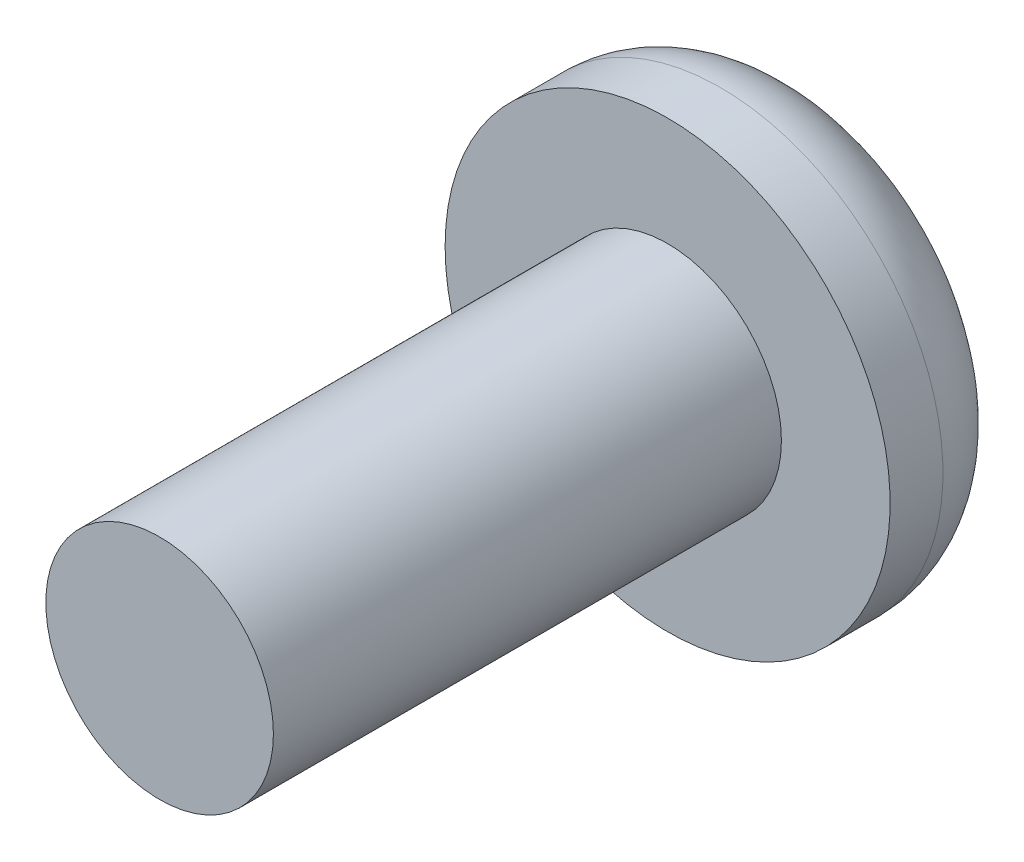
from build123d import *

# Parameters (mm, degrees)
SKETCH1_R          = 1.4224
THREADS_DEPTH      = 6.35
SKETCH2_W          = 2.7813
SKETCH2_H          = 1.7272
FILLET_2_R         = 1.0668
SKETCH4_W          = 0.6858
SKETCH4_H          = 1.4224
CUT_EXTRUDE1_DEPTH = 0.8636
CIRPATTERN2_COUNT  = 4


with BuildPart() as part:
    # Sketch1 → THREADS (new body)
    with BuildSketch(Plane.XY):
        Circle(SKETCH1_R)
    extrude(amount=THREADS_DEPTH)

    # Sketch2 → PANHEAD (revolve)
    with BuildSketch(Plane(origin=(0, 0, 0), x_dir=(1, 0, 0), z_dir=(0, 1, 0)), mode=Mode.PRIVATE) as panhead_sk:
        with Locations((1.39065, 0.8636)):
            Rectangle(SKETCH2_W, SKETCH2_H)
    revolve(panhead_sk.sketch.rotate(Axis((0, 0, -4.840317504), (0, 0, 1)), 180), axis=Axis((0, 0, -4.840317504), (0, 0, 1)))

    # FILLET 2
    fillet_2_edges = [part.edges().sort_by_distance(p)[0] for p in [
        (2.7813, 0, -1.7272),
    ]]
    fillet(fillet_2_edges, radius=FILLET_2_R)

    # Sketch4 → Cut-Extrude1 (cut)
    with BuildSketch(Plane(origin=(-0.355935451, -0.850723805, -1.7272), x_dir=(-1, 0, 0), z_dir=(0, 0, -1))):
        with Locations((-0.355935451, 1.561923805)):
            Rectangle(SKETCH4_W, SKETCH4_H)
    cut_extrude1 = extrude(amount=-CUT_EXTRUDE1_DEPTH, mode=Mode.SUBTRACT)

    # CirPattern2: Cut-Extrude1 ×4 about axis
    cirpattern2_axis = Axis((0, 0, 0), (0, 0, 1))
    for i in range(1, CIRPATTERN2_COUNT):
        add(cut_extrude1.rotate(cirpattern2_axis, i * 360 / CIRPATTERN2_COUNT), mode=Mode.SUBTRACT)


solid = part.part
